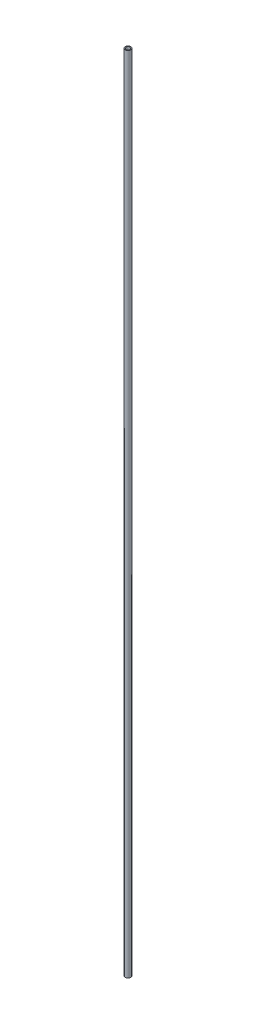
ISO-10303-21;
HEADER;
FILE_DESCRIPTION(('STEP AP214'),'2;1');
FILE_NAME('part.step','',(''),(''),'','','');
FILE_SCHEMA(('AUTOMOTIVE_DESIGN { 1 0 10303 214 1 1 1 1 }'));
ENDSEC;
DATA;
#1=APPLICATION_CONTEXT('core data for automotive mechanical design processes');
#2=APPLICATION_PROTOCOL_DEFINITION('international standard','automotive_design',2000,#1);
#3=PRODUCT_CONTEXT('',#1,'mechanical');
#4=PRODUCT('Part','Part','',(#3));
#5=PRODUCT_RELATED_PRODUCT_CATEGORY('part','',(#4));
#6=PRODUCT_DEFINITION_FORMATION('','',#4);
#7=PRODUCT_DEFINITION_CONTEXT('part definition',#1,'design');
#8=PRODUCT_DEFINITION('design','',#6,#7);
#9=PRODUCT_DEFINITION_SHAPE('','',#8);
#10=(LENGTH_UNIT() NAMED_UNIT(*) SI_UNIT(.MILLI.,.METRE.));
#11=(NAMED_UNIT(*) PLANE_ANGLE_UNIT() SI_UNIT($,.RADIAN.));
#12=(NAMED_UNIT(*) SI_UNIT($,.STERADIAN.) SOLID_ANGLE_UNIT());
#13=UNCERTAINTY_MEASURE_WITH_UNIT(LENGTH_MEASURE(1.E-05),#10,'distance_accuracy_value','');
#14=(GEOMETRIC_REPRESENTATION_CONTEXT(3) GLOBAL_UNCERTAINTY_ASSIGNED_CONTEXT((#13)) GLOBAL_UNIT_ASSIGNED_CONTEXT((#10,
#11,#12)) REPRESENTATION_CONTEXT('',''));
#15=CARTESIAN_POINT('',(0.,0.,0.));
#16=DIRECTION('',(0.,0.,1.));
#17=DIRECTION('',(1.,0.,0.));
#18=AXIS2_PLACEMENT_3D('',#15,#16,#17);
#19=CARTESIAN_POINT('',(0.,3048.,0.));
#20=DIRECTION('',(0.,1.,0.));
#21=DIRECTION('',(0.,0.,1.));
#22=AXIS2_PLACEMENT_3D('',#19,#20,#21);
#23=PLANE('',#22);
#24=CARTESIAN_POINT('',(0.,3048.,0.));
#25=DIRECTION('',(0.,1.,0.));
#26=DIRECTION('',(0.,0.,1.));
#27=AXIS2_PLACEMENT_3D('',#24,#25,#26);
#28=CIRCLE('',#27,10.668);
#29=CARTESIAN_POINT('',(0.,3048.,10.668));
#30=VERTEX_POINT('',#29);
#31=EDGE_CURVE('E10',#30,#30,#28,.T.);
#32=ORIENTED_EDGE('',*,*,#31,.T.);
#33=EDGE_LOOP('',(#32));
#34=FACE_BOUND('',#33,.T.);
#35=CARTESIAN_POINT('',(0.,3048.,0.));
#36=DIRECTION('',(0.,1.,0.));
#37=DIRECTION('',(0.,0.,1.));
#38=AXIS2_PLACEMENT_3D('',#35,#36,#37);
#39=CIRCLE('',#38,7.6454);
#40=CARTESIAN_POINT('',(0.,3048.,7.6454));
#41=VERTEX_POINT('',#40);
#42=EDGE_CURVE('E51',#41,#41,#39,.T.);
#43=ORIENTED_EDGE('',*,*,#42,.F.);
#44=EDGE_LOOP('',(#43));
#45=FACE_BOUND('',#44,.T.);
#46=ADVANCED_FACE('F40',(#34,#45),#23,.T.);
#47=CARTESIAN_POINT('',(0.,0.,0.));
#48=DIRECTION('',(0.,1.,0.));
#49=DIRECTION('',(0.,0.,1.));
#50=AXIS2_PLACEMENT_3D('',#47,#48,#49);
#51=PLANE('',#50);
#52=CARTESIAN_POINT('',(0.,0.,0.));
#53=DIRECTION('',(0.,1.,0.));
#54=DIRECTION('',(0.,0.,1.));
#55=AXIS2_PLACEMENT_3D('',#52,#53,#54);
#56=CIRCLE('',#55,10.668);
#57=CARTESIAN_POINT('',(0.,0.,10.668));
#58=VERTEX_POINT('',#57);
#59=EDGE_CURVE('E44',#58,#58,#56,.T.);
#60=ORIENTED_EDGE('',*,*,#59,.F.);
#61=EDGE_LOOP('',(#60));
#62=FACE_BOUND('',#61,.T.);
#63=CARTESIAN_POINT('',(0.,0.,0.));
#64=DIRECTION('',(0.,1.,0.));
#65=DIRECTION('',(0.,0.,1.));
#66=AXIS2_PLACEMENT_3D('',#63,#64,#65);
#67=CIRCLE('',#66,7.6454);
#68=CARTESIAN_POINT('',(0.,0.,7.6454));
#69=VERTEX_POINT('',#68);
#70=EDGE_CURVE('E53',#69,#69,#67,.T.);
#71=ORIENTED_EDGE('',*,*,#70,.T.);
#72=EDGE_LOOP('',(#71));
#73=FACE_BOUND('',#72,.T.);
#74=ADVANCED_FACE('F63',(#62,#73),#51,.F.);
#75=CARTESIAN_POINT('',(0.,3048.,0.));
#76=DIRECTION('',(0.,-1.,0.));
#77=DIRECTION('',(0.,0.,-1.));
#78=AXIS2_PLACEMENT_3D('',#75,#76,#77);
#79=CYLINDRICAL_SURFACE('',#78,10.668);
#80=ORIENTED_EDGE('',*,*,#31,.F.);
#81=EDGE_LOOP('',(#80));
#82=FACE_BOUND('',#81,.T.);
#83=ORIENTED_EDGE('',*,*,#59,.T.);
#84=EDGE_LOOP('',(#83));
#85=FACE_BOUND('',#84,.T.);
#86=ADVANCED_FACE('F42',(#82,#85),#79,.T.);
#87=CARTESIAN_POINT('',(0.,3048.,0.));
#88=DIRECTION('',(0.,-1.,0.));
#89=DIRECTION('',(0.,0.,-1.));
#90=AXIS2_PLACEMENT_3D('',#87,#88,#89);
#91=CYLINDRICAL_SURFACE('',#90,7.6454);
#92=ORIENTED_EDGE('',*,*,#42,.T.);
#93=EDGE_LOOP('',(#92));
#94=FACE_BOUND('',#93,.T.);
#95=ORIENTED_EDGE('',*,*,#70,.F.);
#96=EDGE_LOOP('',(#95));
#97=FACE_BOUND('',#96,.T.);
#98=ADVANCED_FACE('F59',(#94,#97),#91,.F.);
#99=CLOSED_SHELL('',(#46,#74,#86,#98));
#100=MANIFOLD_SOLID_BREP('B2',#99);
#101=ADVANCED_BREP_SHAPE_REPRESENTATION('',(#18,#100),#14);
#102=SHAPE_DEFINITION_REPRESENTATION(#9,#101);
ENDSEC;
END-ISO-10303-21;
